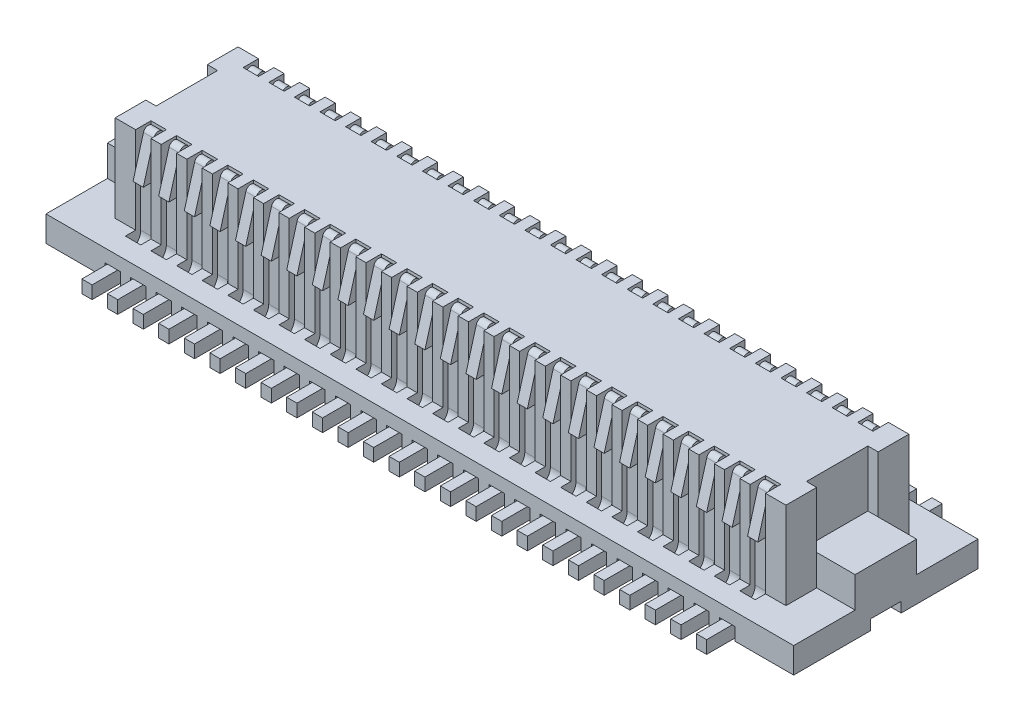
from build123d import *

# Parameters (mm, degrees)
EXTRUDE_1_DEPTH        = 7.3
EXTRUDE_3_DEPTH        = 1.7
CUT_EXTRUDE_1_DEPTH    = 0.15
EXTRUDE_4_DEPTH        = 0.1
PATTERN_LINEAR_1_COUNT = 25
PATTERN_LINEAR_1_PITCH = 0.5


with BuildPart() as part:
    # Sketch 1 → Extrude 1 (new, symmetric)
    with BuildSketch(Plane(origin=(0, 0, 0), x_dir=(0, 0, -1), z_dir=(1, 0, 0))):
        Polygon((-0.3, 0), (-0.3, 0.2), (0.3, 0.2), (0.3, 0), (1.8, 0), (1.8, 0.5), (0.6, 0.5), (0.6, 1.1), (-0.6, 1.1), (-0.6, 0.5), (-1.8, 0.5), (-1.8, 0), align=None)
    extrude(amount=EXTRUDE_1_DEPTH, both=True)

    # Sketch 2 → Extrude 3 (add)
    with BuildSketch(Plane(origin=(0, 0.5, 0), x_dir=(-1, 0, 0), z_dir=(0, 1, 0))):
        Polygon((6.55, 1.2), (-6.55, 1.2), (-6.55, 0.6), (-6.35, 0.6), (-6.35, -0.6), (-6.55, -0.6), (-6.55, -1.2), (6.55, -1.2), (6.55, -0.6), (6.35, -0.6), (6.35, 0.6), (6.55, 0.6), align=None)
    extrude(amount=EXTRUDE_3_DEPTH)

    # Sketch 4 → Cut-Extrude 1 (cut, symmetric)
    with BuildSketch(Plane(origin=(-6, 0, 0), x_dir=(0, 0, -1), z_dir=(1, 0, 0))):
        Polygon((-0.9, 2.2), (-0.9, 0), (-1.8, 0), (-1.8, 0.25), (-1.4, 0.25), (-1.4, 2.2), align=None)
        Polygon((1.4, 2.2), (0.9, 2.2), (0.9, 0), (1.8, 0), (1.8, 0.25), (1.4, 0.25), align=None)
    cut_extrude_1 = extrude(amount=CUT_EXTRUDE_1_DEPTH, both=True, mode=Mode.SUBTRACT)

    # Sketch 5 → Extrude 4 (add, symmetric)
    with BuildSketch(Plane(origin=(-6, 0, 0), x_dir=(0, 0, -1), z_dir=(1, 0, 0))):
        with BuildLine():
            Line((-0.9, 2.1), (-0.9, 0.5))
            ThreePointArc((-0.9, 0.5), (-1.046446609, 0.146446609), (-1.4, 0))
            Line((-1.4, 0), (-2.3, 0))
            Line((-2.3, 0), (-2.3, 0.25))
            Line((-2.3, 0.25), (-1.4, 0.25))
            ThreePointArc((-1.4, 0.25), (-1.223223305, 0.323223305), (-1.15, 0.5))
            Line((-1.15, 0.5), (-1.15, 1.4))
            Line((-1.15, 1.4), (-1.3, 1.4))
            Line((-1.3, 1.4), (-1.096291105, 2.126981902))
            ThreePointArc((-1.096291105, 2.126981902), (-0.98638219, 2.199068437), (-0.9, 2.1))
        make_face()
        with BuildLine():
            Line((1.3, 1.4), (1.096291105, 2.126981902))
            ThreePointArc((1.096291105, 2.126981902), (0.98638219, 2.199068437), (0.9, 2.1))
            Line((0.9, 2.1), (0.9, 0.5))
            ThreePointArc((0.9, 0.5), (1.046446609, 0.146446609), (1.4, 0))
            Line((1.4, 0), (2.3, 0))
            Line((2.3, 0), (2.3, 0.25))
            Line((2.3, 0.25), (1.4, 0.25))
            ThreePointArc((1.4, 0.25), (1.223223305, 0.323223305), (1.15, 0.5))
            Line((1.15, 0.5), (1.15, 1.4))
            Line((1.15, 1.4), (1.3, 1.4))
        make_face()
    extrude_4 = extrude(amount=EXTRUDE_4_DEPTH, both=True)

    # Pattern Linear 1: Cut-Extrude 1, Extrude 4 ×25
    with Locations(*[(i * PATTERN_LINEAR_1_PITCH, 0, 0) for i in range(1, PATTERN_LINEAR_1_COUNT)]):
        add(cut_extrude_1, mode=Mode.SUBTRACT)
        add(extrude_4)


solid = part.part
